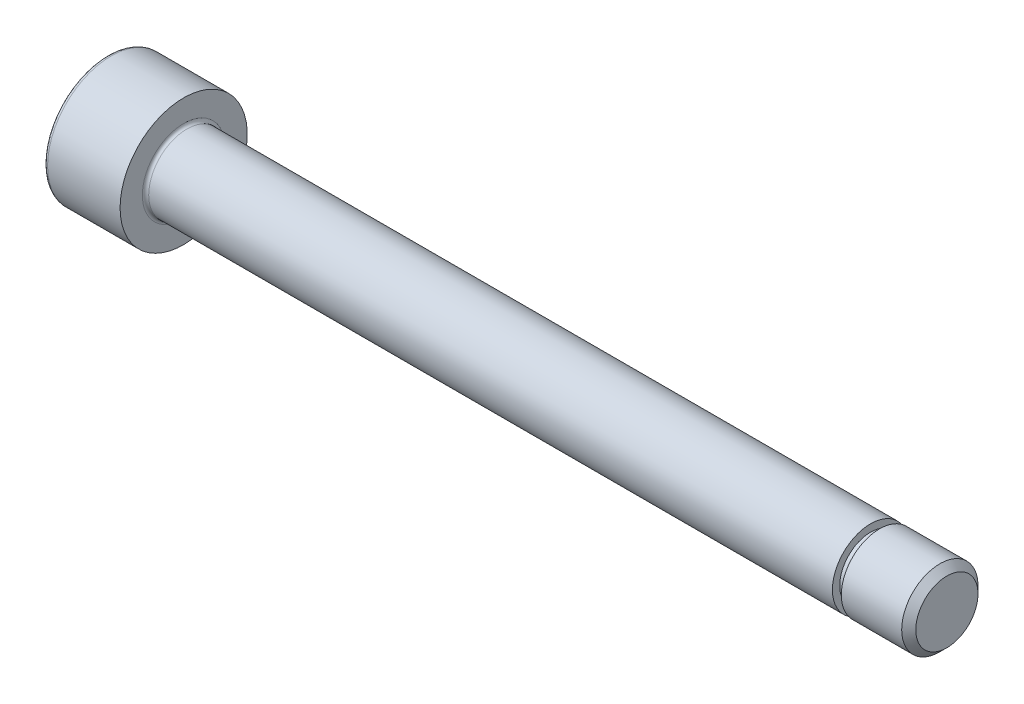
from build123d import *

# Parameters (mm, degrees)
FILLET1_R   = 0.25
FILLET2_R   = 0.3
HEX_2_DEPTH = 3
ESQUISSE1_W = 0.7
ESQUISSE1_H = 3.530955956


with BuildPart() as part:
    # BodySke → Base-Revolve (revolve)
    with BuildSketch(Plane.XY, mode=Mode.PRIVATE) as base_revolve_sk:
        Polygon((0, 0), (0, 5), (6, 5), (6, 3), (65.4455, 3), (66, 2.4455), (66, 0), align=None)
    revolve(base_revolve_sk.sketch.rotate(Axis((-31.75, 0, 0), (1, 0, 0)), 90), axis=Axis((-31.75, 0, 0), (1, 0, 0)))

    # Fillet1
    fillet1_edges = [part.edges().sort_by_distance(p)[0] for p in [
        (6, 0, -3),
    ]]
    fillet(fillet1_edges, radius=FILLET1_R)

    # Fillet2
    fillet2_edges = [part.edges().sort_by_distance(p)[0] for p in [
        (0, 0, -5),
    ]]
    fillet(fillet2_edges, radius=FILLET2_R)

    # Sketch2 → Hex-PreBroach (revolve, cut)
    with BuildSketch(Plane.XY, mode=Mode.PRIVATE) as hex_prebroach_sk:
        Polygon((0, 2.542), (3, 2.542), (4.467624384, 0), (0, 0), align=None)
    revolve(hex_prebroach_sk.sketch.rotate(Axis((0, 0, 0), (1, 0, 0)), 90), axis=Axis((0, 0, 0), (1, 0, 0)), mode=Mode.SUBTRACT)

    # Sketch3 → Hex 2 (cut)
    with BuildSketch(Plane(origin=(0, 0, 0), x_dir=(0, 0.500000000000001, 0.866025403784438), z_dir=(-1, 0, 0))):
        Polygon((1.467624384, 2.542), (-1.467624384, 2.542), (-2.935248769, 0), (-1.467624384, -2.542), (1.467624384, -2.542), (2.935248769, 0), align=None)
    extrude(amount=-HEX_2_DEPTH, mode=Mode.SUBTRACT)

    # Esquisse1 → Enl_vement de mati_re-R_volution1 (revolve, cut)
    with BuildSketch(Plane.XY, mode=Mode.PRIVATE) as enl_vement_de_mati_re_r_volution1_sk:
        with Locations((60.35, 4.190477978)):
            Rectangle(ESQUISSE1_W, ESQUISSE1_H)
    revolve(enl_vement_de_mati_re_r_volution1_sk.sketch.rotate(Axis((66.367150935, 0, 0), (-1, 0, 0)), 270), axis=Axis((66.367150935, 0, 0), (-1, 0, 0)), mode=Mode.SUBTRACT)


solid = part.part
